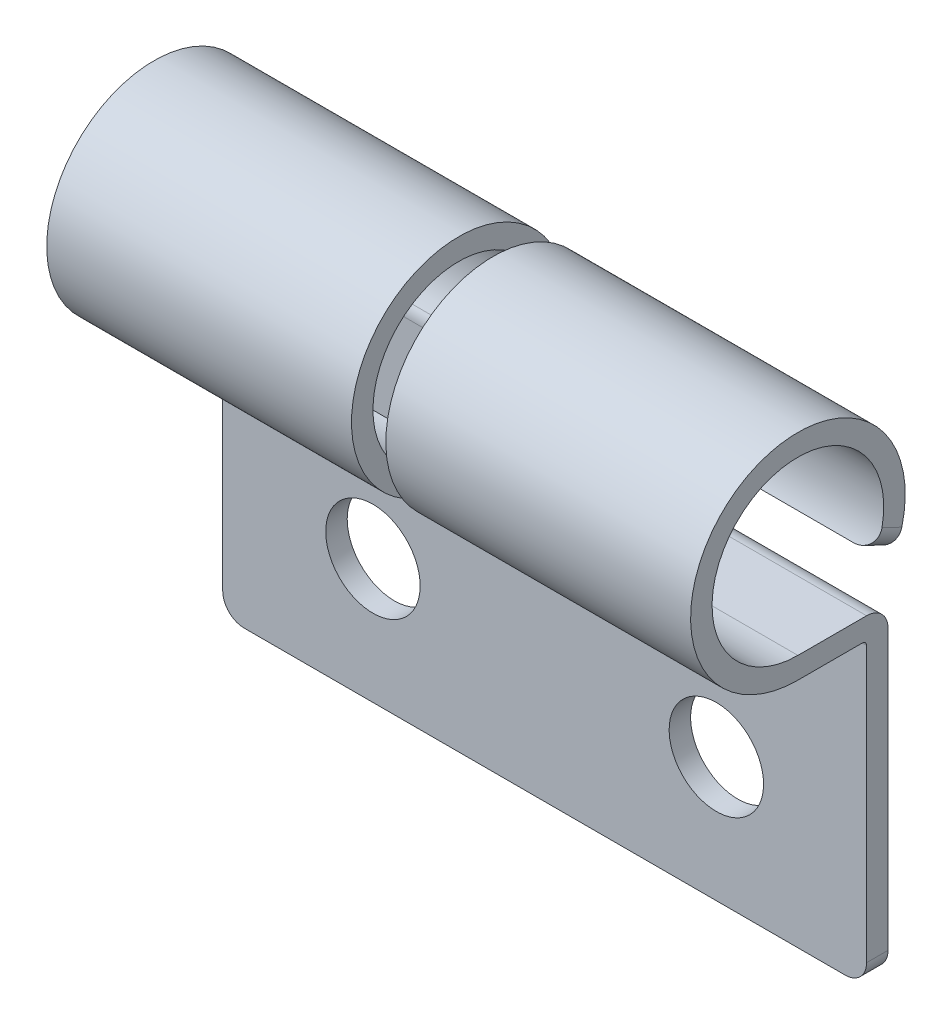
ISO-10303-21;
HEADER;
FILE_DESCRIPTION(('STEP AP214'),'2;1');
FILE_NAME('part.step','',(''),(''),'','','');
FILE_SCHEMA(('AUTOMOTIVE_DESIGN { 1 0 10303 214 1 1 1 1 }'));
ENDSEC;
DATA;
#1=APPLICATION_CONTEXT('core data for automotive mechanical design processes');
#2=APPLICATION_PROTOCOL_DEFINITION('international standard','automotive_design',2000,#1);
#3=PRODUCT_CONTEXT('',#1,'mechanical');
#4=PRODUCT('Part','Part','',(#3));
#5=PRODUCT_RELATED_PRODUCT_CATEGORY('part','',(#4));
#6=PRODUCT_DEFINITION_FORMATION('','',#4);
#7=PRODUCT_DEFINITION_CONTEXT('part definition',#1,'design');
#8=PRODUCT_DEFINITION('design','',#6,#7);
#9=PRODUCT_DEFINITION_SHAPE('','',#8);
#10=(LENGTH_UNIT() NAMED_UNIT(*) SI_UNIT(.MILLI.,.METRE.));
#11=(NAMED_UNIT(*) PLANE_ANGLE_UNIT() SI_UNIT($,.RADIAN.));
#12=(NAMED_UNIT(*) SI_UNIT($,.STERADIAN.) SOLID_ANGLE_UNIT());
#13=UNCERTAINTY_MEASURE_WITH_UNIT(LENGTH_MEASURE(1.E-05),#10,'distance_accuracy_value','');
#14=(GEOMETRIC_REPRESENTATION_CONTEXT(3) GLOBAL_UNCERTAINTY_ASSIGNED_CONTEXT((#13)) GLOBAL_UNIT_ASSIGNED_CONTEXT((#10,
#11,#12)) REPRESENTATION_CONTEXT('',''));
#15=CARTESIAN_POINT('',(0.,0.,0.));
#16=DIRECTION('',(0.,0.,1.));
#17=DIRECTION('',(1.,0.,0.));
#18=AXIS2_PLACEMENT_3D('',#15,#16,#17);
#19=CARTESIAN_POINT('',(7.5,0.,0.));
#20=DIRECTION('',(-1.,0.,0.));
#21=DIRECTION('',(0.,0.,1.));
#22=AXIS2_PLACEMENT_3D('',#19,#20,#21);
#23=CYLINDRICAL_SURFACE('',#22,2.);
#24=CARTESIAN_POINT('',(0.4,0.,0.));
#25=DIRECTION('',(1.,0.,0.));
#26=DIRECTION('',(0.,1.,0.));
#27=AXIS2_PLACEMENT_3D('',#24,#25,#26);
#28=CIRCLE('',#27,2.);
#29=CARTESIAN_POINT('',(0.4,-0.399438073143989,-1.95970641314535));
#30=VERTEX_POINT('',#29);
#31=CARTESIAN_POINT('',(0.4,-2.,0.));
#32=VERTEX_POINT('',#31);
#33=EDGE_CURVE('E229',#30,#32,#28,.T.);
#34=ORIENTED_EDGE('',*,*,#33,.F.);
#35=CARTESIAN_POINT('',(0.4,-0.399438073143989,-1.95970641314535));
#36=CARTESIAN_POINT('',(0.399971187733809,-0.426918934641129,-1.95412802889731));
#37=CARTESIAN_POINT('',(0.402209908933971,-0.45428363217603,-1.94792633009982));
#38=CARTESIAN_POINT('',(0.411174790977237,-0.508024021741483,-1.93459398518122));
#39=CARTESIAN_POINT('',(0.417899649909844,-0.534399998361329,-1.92746360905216));
#40=CARTESIAN_POINT('',(0.435802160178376,-0.585459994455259,-1.91257722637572));
#41=CARTESIAN_POINT('',(0.446986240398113,-0.610141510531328,-1.90482032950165));
#42=CARTESIAN_POINT('',(0.473532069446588,-0.657070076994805,-1.88914524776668));
#43=CARTESIAN_POINT('',(0.488891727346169,-0.679318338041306,-1.88122714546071));
#44=CARTESIAN_POINT('',(0.523093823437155,-0.720479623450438,-1.86584714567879));
#45=CARTESIAN_POINT('',(0.541876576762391,-0.739440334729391,-1.85837997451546));
#46=CARTESIAN_POINT('',(0.582565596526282,-0.77402535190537,-1.84424363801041));
#47=CARTESIAN_POINT('',(0.604472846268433,-0.789648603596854,-1.83757472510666));
#48=CARTESIAN_POINT('',(0.650946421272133,-0.817316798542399,-1.8254379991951));
#49=CARTESIAN_POINT('',(0.675529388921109,-0.829337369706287,-1.81997842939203));
#50=CARTESIAN_POINT('',(0.72654351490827,-0.849424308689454,-1.81069082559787));
#51=CARTESIAN_POINT('',(0.752973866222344,-0.857492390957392,-1.80686208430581));
#52=CARTESIAN_POINT('',(0.799578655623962,-0.867891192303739,-1.80188484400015));
#53=CARTESIAN_POINT('',(0.819497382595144,-0.871185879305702,-1.80029044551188));
#54=CARTESIAN_POINT('',(0.859608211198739,-0.875580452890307,-1.79815468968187));
#55=CARTESIAN_POINT('',(0.879799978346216,-0.87668281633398,-1.79761214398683));
#56=CARTESIAN_POINT('',(0.9,-0.8766808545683,-1.79761805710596));
#57=B_SPLINE_CURVE_WITH_KNOTS('',3,(#35,#36,#37,#38,#39,#40,#41,#42,#43,#44,#45,#46,#47,#48,#49,
#50,#51,#52,#53,#54,#55,#56),.UNSPECIFIED.,.F.,.F.,(4,2,2,2,2,2,2,2,2,2,4),(0.,
0.0840428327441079,0.168061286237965,0.252201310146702,0.33629927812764,0.419051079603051,
0.501828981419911,0.585154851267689,0.668444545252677,0.729060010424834,0.789606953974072),.UNSPECIFIED.);
#58=CARTESIAN_POINT('',(0.9,-0.8766808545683,-1.79761805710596));
#59=VERTEX_POINT('',#58);
#60=EDGE_CURVE('E312',#30,#59,#57,.T.);
#61=ORIENTED_EDGE('',*,*,#60,.T.);
#62=DIRECTION('',(-1.,0.,0.));
#63=VECTOR('',#62,1.);
#64=CARTESIAN_POINT('',(7.5,-0.8766808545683,-1.79761805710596));
#65=LINE('',#64,#63);
#66=CARTESIAN_POINT('',(7.,-0.8766808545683,-1.79761805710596));
#67=VERTEX_POINT('',#66);
#68=EDGE_CURVE('E290',#67,#59,#65,.T.);
#69=ORIENTED_EDGE('',*,*,#68,.F.);
#70=CARTESIAN_POINT('',(7.,-0.8766808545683,-1.79761805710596));
#71=CARTESIAN_POINT('',(7.02811167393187,-0.876694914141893,-1.7975924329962));
#72=CARTESIAN_POINT('',(7.05621639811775,-0.874551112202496,-1.7986563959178));
#73=CARTESIAN_POINT('',(7.11161328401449,-0.866050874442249,-1.80277452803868));
#74=CARTESIAN_POINT('',(7.13890598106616,-0.859697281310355,-1.80582735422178));
#75=CARTESIAN_POINT('',(7.19193382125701,-0.842875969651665,-1.81373675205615));
#76=CARTESIAN_POINT('',(7.21766815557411,-0.832406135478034,-1.81859425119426));
#77=CARTESIAN_POINT('',(7.26682744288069,-0.80755984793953,-1.82976313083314));
#78=CARTESIAN_POINT('',(7.29025278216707,-0.793184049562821,-1.83607426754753));
#79=CARTESIAN_POINT('',(7.33406712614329,-0.760864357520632,-1.84970021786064));
#80=CARTESIAN_POINT('',(7.35446390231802,-0.742929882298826,-1.85701236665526));
#81=CARTESIAN_POINT('',(7.39170634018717,-0.703877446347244,-1.87216295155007));
#82=CARTESIAN_POINT('',(7.40855222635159,-0.682759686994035,-1.88000135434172));
#83=CARTESIAN_POINT('',(7.43806150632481,-0.638114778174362,-1.89561657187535));
#84=CARTESIAN_POINT('',(7.45076759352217,-0.614615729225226,-1.90339315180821));
#85=CARTESIAN_POINT('',(7.47192694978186,-0.565644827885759,-1.91851540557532));
#86=CARTESIAN_POINT('',(7.48038090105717,-0.54017329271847,-1.92586114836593));
#87=CARTESIAN_POINT('',(7.49110536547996,-0.495424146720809,-1.9377636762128));
#88=CARTESIAN_POINT('',(7.49445113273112,-0.476448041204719,-1.94251901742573));
#89=CARTESIAN_POINT('',(7.49889883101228,-0.438148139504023,-1.95151665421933));
#90=CARTESIAN_POINT('',(7.50000448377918,-0.418824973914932,-1.95575978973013));
#91=CARTESIAN_POINT('',(7.5,-0.399438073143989,-1.95970641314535));
#92=B_SPLINE_CURVE_WITH_KNOTS('',3,(#70,#71,#72,#73,#74,#75,#76,#77,#78,#79,#80,#81,#82,#83,#84,
#85,#86,#87,#88,#89,#90,#91),.UNSPECIFIED.,.F.,.F.,(4,2,2,2,2,2,2,2,2,2,4),(0.,
0.0842234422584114,0.16839006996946,0.252600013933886,0.336795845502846,0.420771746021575,
0.504742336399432,0.5878173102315,0.670878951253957,0.730289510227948,0.78960128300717),.UNSPECIFIED.);
#93=CARTESIAN_POINT('',(7.5,-0.399438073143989,-1.95970641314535));
#94=VERTEX_POINT('',#93);
#95=EDGE_CURVE('E403',#67,#94,#92,.T.);
#96=ORIENTED_EDGE('',*,*,#95,.T.);
#97=CARTESIAN_POINT('',(7.5,0.,0.));
#98=DIRECTION('',(1.,0.,0.));
#99=DIRECTION('',(0.,0.,-1.));
#100=AXIS2_PLACEMENT_3D('',#97,#98,#99);
#101=CIRCLE('',#100,2.);
#102=CARTESIAN_POINT('',(7.5,-2.,0.));
#103=VERTEX_POINT('',#102);
#104=EDGE_CURVE('E275',#94,#103,#101,.T.);
#105=ORIENTED_EDGE('',*,*,#104,.T.);
#106=DIRECTION('',(-1.,0.,0.));
#107=VECTOR('',#106,1.);
#108=CARTESIAN_POINT('',(7.5,-2.,0.));
#109=LINE('',#108,#107);
#110=EDGE_CURVE('E286',#103,#32,#109,.T.);
#111=ORIENTED_EDGE('',*,*,#110,.T.);
#112=EDGE_LOOP('',(#34,#61,#69,#96,#105,#111));
#113=FACE_BOUND('',#112,.T.);
#114=ADVANCED_FACE('F34',(#113),#23,.F.);
#115=CARTESIAN_POINT('',(7.5,0.,0.));
#116=DIRECTION('',(-1.,0.,0.));
#117=DIRECTION('',(0.,0.,1.));
#118=AXIS2_PLACEMENT_3D('',#115,#116,#117);
#119=CYLINDRICAL_SURFACE('',#118,2.5);
#120=CARTESIAN_POINT('',(-0.399999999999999,0.,0.));
#121=DIRECTION('',(-1.,0.,0.));
#122=DIRECTION('',(0.,0.,1.));
#123=AXIS2_PLACEMENT_3D('',#120,#121,#122);
#124=CIRCLE('',#123,2.5);
#125=CARTESIAN_POINT('',(-0.399999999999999,-2.44948974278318,0.5));
#126=VERTEX_POINT('',#125);
#127=CARTESIAN_POINT('',(-0.399999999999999,-1.33234677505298,-2.11538461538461));
#128=VERTEX_POINT('',#127);
#129=EDGE_CURVE('E487',#126,#128,#124,.T.);
#130=ORIENTED_EDGE('',*,*,#129,.T.);
#131=DIRECTION('',(-1.,0.,0.));
#132=VECTOR('',#131,1.);
#133=CARTESIAN_POINT('',(7.5,-1.33234677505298,-2.11538461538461));
#134=LINE('',#133,#132);
#135=CARTESIAN_POINT('',(-7.5,-1.33234677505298,-2.11538461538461));
#136=VERTEX_POINT('',#135);
#137=EDGE_CURVE('E49',#128,#136,#134,.T.);
#138=ORIENTED_EDGE('',*,*,#137,.T.);
#139=CARTESIAN_POINT('',(-7.5,0.,0.));
#140=DIRECTION('',(-1.,0.,0.));
#141=DIRECTION('',(0.,0.,1.));
#142=AXIS2_PLACEMENT_3D('',#139,#140,#141);
#143=CIRCLE('',#142,2.5);
#144=CARTESIAN_POINT('',(-7.5,-2.44948974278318,0.5));
#145=VERTEX_POINT('',#144);
#146=EDGE_CURVE('E250',#145,#136,#143,.T.);
#147=ORIENTED_EDGE('',*,*,#146,.F.);
#148=CARTESIAN_POINT('',(-7.5,-2.44948974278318,0.5));
#149=CARTESIAN_POINT('',(-7.50002723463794,-2.45512197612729,0.47249827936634));
#150=CARTESIAN_POINT('',(-7.49773190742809,-2.46025688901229,0.444890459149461));
#151=CARTESIAN_POINT('',(-7.48858967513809,-2.46949921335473,0.39027706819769));
#152=CARTESIAN_POINT('',(-7.48174492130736,-2.47360710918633,0.363271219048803));
#153=CARTESIAN_POINT('',(-7.46358720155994,-2.4807718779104,0.310619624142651));
#154=CARTESIAN_POINT('',(-7.45226930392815,-2.48382758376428,0.284975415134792));
#155=CARTESIAN_POINT('',(-7.4254638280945,-2.48896992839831,0.235874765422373));
#156=CARTESIAN_POINT('',(-7.40997784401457,-2.49105693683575,0.21241749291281));
#157=CARTESIAN_POINT('',(-7.37544375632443,-2.49440286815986,0.168621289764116));
#158=CARTESIAN_POINT('',(-7.35643413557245,-2.49567012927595,0.148252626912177));
#159=CARTESIAN_POINT('',(-7.31527711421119,-2.49760756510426,0.110934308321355));
#160=CARTESIAN_POINT('',(-7.29312885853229,-2.49827757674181,0.093985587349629));
#161=CARTESIAN_POINT('',(-7.24621783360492,-2.49922805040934,0.0639305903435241));
#162=CARTESIAN_POINT('',(-7.2214438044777,-2.49950675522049,0.0508418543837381));
#163=CARTESIAN_POINT('',(-7.17006335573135,-2.49985600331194,0.0289830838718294));
#164=CARTESIAN_POINT('',(-7.14345783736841,-2.49992664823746,0.0202109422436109));
#165=CARTESIAN_POINT('',(-7.09727684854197,-2.49998741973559,0.00916269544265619));
#166=CARTESIAN_POINT('',(-7.07796984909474,-2.49999527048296,0.00572966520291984));
#167=CARTESIAN_POINT('',(-7.03911111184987,-2.50000000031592,0.00114796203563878));
#168=CARTESIAN_POINT('',(-7.01955970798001,-2.49999689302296,-3.54417115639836E-06));
#169=CARTESIAN_POINT('',(-7.,-2.5,0.));
#170=B_SPLINE_CURVE_WITH_KNOTS('',3,(#148,#149,#150,#151,#152,#153,#154,#155,#156,#157,#158,
#159,#160,#161,#162,#163,#164,#165,#166,#167,#168,#169),.UNSPECIFIED.,.F.,.F.,(4,2,2,2,2,2,2,2,
2,2,4),(0.,0.0841256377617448,0.168211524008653,0.25239037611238,0.33653707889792,
0.419813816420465,0.503113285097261,0.586785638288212,0.670417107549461,0.729119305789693,
0.787748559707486),.UNSPECIFIED.);
#171=CARTESIAN_POINT('',(-7.,-2.5,0.));
#172=VERTEX_POINT('',#171);
#173=EDGE_CURVE('E353',#145,#172,#170,.T.);
#174=ORIENTED_EDGE('',*,*,#173,.T.);
#175=DIRECTION('',(1.,0.,0.));
#176=VECTOR('',#175,1.);
#177=CARTESIAN_POINT('',(-7.5,-2.5,0.));
#178=LINE('',#177,#176);
#179=CARTESIAN_POINT('',(-0.9,-2.5,0.));
#180=VERTEX_POINT('',#179);
#181=EDGE_CURVE('E252',#172,#180,#178,.T.);
#182=ORIENTED_EDGE('',*,*,#181,.T.);
#183=CARTESIAN_POINT('',(-0.9,-2.5,0.));
#184=CARTESIAN_POINT('',(-0.871882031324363,-2.49998649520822,-2.38767705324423E-05));
#185=CARTESIAN_POINT('',(-0.843771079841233,-2.49999977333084,0.00237043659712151));
#186=CARTESIAN_POINT('',(-0.7883633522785,-2.49998008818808,0.0118196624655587));
#187=CARTESIAN_POINT('',(-0.761066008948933,-2.49994715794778,0.0188712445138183));
#188=CARTESIAN_POINT('',(-0.708029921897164,-2.49973546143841,0.0374643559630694));
#189=CARTESIAN_POINT('',(-0.682291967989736,-2.49955662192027,0.0490081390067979));
#190=CARTESIAN_POINT('',(-0.633125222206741,-2.4988742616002,0.0762464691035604));
#191=CARTESIAN_POINT('',(-0.609696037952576,-2.498370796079,0.0919403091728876));
#192=CARTESIAN_POINT('',(-0.565849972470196,-2.4968335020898,0.126998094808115));
#193=CARTESIAN_POINT('',(-0.54542810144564,-2.49580056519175,0.14635583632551));
#194=CARTESIAN_POINT('',(-0.508133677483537,-2.49299482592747,0.188189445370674));
#195=CARTESIAN_POINT('',(-0.491261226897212,-2.49122200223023,0.210665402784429));
#196=CARTESIAN_POINT('',(-0.461644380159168,-2.48677497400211,0.257892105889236));
#197=CARTESIAN_POINT('',(-0.448872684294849,-2.48410698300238,0.282626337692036));
#198=CARTESIAN_POINT('',(-0.427635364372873,-2.47775486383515,0.333755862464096));
#199=CARTESIAN_POINT('',(-0.419168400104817,-2.47407105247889,0.360150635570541));
#200=CARTESIAN_POINT('',(-0.408624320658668,-2.46695406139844,0.405577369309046));
#201=CARTESIAN_POINT('',(-0.405384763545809,-2.46378906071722,0.424391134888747));
#202=CARTESIAN_POINT('',(-0.40107249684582,-2.45698771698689,0.462150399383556));
#203=CARTESIAN_POINT('',(-0.399996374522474,-2.45335212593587,0.481095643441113));
#204=CARTESIAN_POINT('',(-0.4,-2.44948974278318,0.5));
#205=B_SPLINE_CURVE_WITH_KNOTS('',3,(#183,#184,#185,#186,#187,#188,#189,#190,#191,#192,#193,
#194,#195,#196,#197,#198,#199,#200,#201,#202,#203,#204),.UNSPECIFIED.,.F.,.F.,(4,2,2,2,2,2,2,2,
2,2,4),(0.,0.0842421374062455,0.168424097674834,0.252648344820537,0.336858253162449,
0.420926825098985,0.504997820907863,0.588496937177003,0.671970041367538,0.729903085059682,
0.787744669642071),.UNSPECIFIED.);
#206=EDGE_CURVE('E361',#180,#126,#205,.T.);
#207=ORIENTED_EDGE('',*,*,#206,.T.);
#208=EDGE_LOOP('',(#130,#138,#147,#174,#182,#207));
#209=FACE_BOUND('',#208,.T.);
#210=ADVANCED_FACE('F348',(#209),#119,.T.);
#211=CARTESIAN_POINT('',(7.5,-2.5,-1.6));
#212=DIRECTION('',(0.,0.,-1.));
#213=DIRECTION('',(0.,1.,0.));
#214=AXIS2_PLACEMENT_3D('',#211,#212,#213);
#215=PLANE('',#214);
#216=CARTESIAN_POINT('',(4.,-6.6,-1.6));
#217=DIRECTION('',(0.,0.,-1.));
#218=DIRECTION('',(0.,1.,0.));
#219=AXIS2_PLACEMENT_3D('',#216,#217,#218);
#220=CIRCLE('',#219,1.1);
#221=CARTESIAN_POINT('',(4.,-5.5,-1.6));
#222=VERTEX_POINT('',#221);
#223=EDGE_CURVE('E497',#222,#222,#220,.T.);
#224=ORIENTED_EDGE('',*,*,#223,.T.);
#225=EDGE_LOOP('',(#224));
#226=FACE_BOUND('',#225,.T.);
#227=CARTESIAN_POINT('',(-4.,-6.6,-1.6));
#228=DIRECTION('',(0.,0.,-1.));
#229=DIRECTION('',(0.,1.,0.));
#230=AXIS2_PLACEMENT_3D('',#227,#228,#229);
#231=CIRCLE('',#230,1.1);
#232=CARTESIAN_POINT('',(-4.,-5.5,-1.6));
#233=VERTEX_POINT('',#232);
#234=EDGE_CURVE('E214',#233,#233,#231,.T.);
#235=ORIENTED_EDGE('',*,*,#234,.T.);
#236=EDGE_LOOP('',(#235));
#237=FACE_BOUND('',#236,.T.);
#238=DIRECTION('',(0.,-1.,0.));
#239=VECTOR('',#238,1.);
#240=CARTESIAN_POINT('',(7.5,-2.5,-1.6));
#241=LINE('',#240,#239);
#242=CARTESIAN_POINT('',(7.5,-2.6,-1.6));
#243=VERTEX_POINT('',#242);
#244=CARTESIAN_POINT('',(7.5,-9.,-1.6));
#245=VERTEX_POINT('',#244);
#246=EDGE_CURVE('E264',#243,#245,#241,.T.);
#247=ORIENTED_EDGE('',*,*,#246,.F.);
#248=DIRECTION('',(-1.,0.,0.));
#249=VECTOR('',#248,1.);
#250=CARTESIAN_POINT('',(0.4,-2.6,-1.6));
#251=LINE('',#250,#249);
#252=CARTESIAN_POINT('',(0.4,-2.6,-1.6));
#253=VERTEX_POINT('',#252);
#254=EDGE_CURVE('E442',#243,#253,#251,.T.);
#255=ORIENTED_EDGE('',*,*,#254,.T.);
#256=DIRECTION('',(0.,-1.,0.));
#257=VECTOR('',#256,1.);
#258=CARTESIAN_POINT('',(0.4,-2.5,-1.6));
#259=LINE('',#258,#257);
#260=CARTESIAN_POINT('',(0.4,-3.1,-1.6));
#261=VERTEX_POINT('',#260);
#262=EDGE_CURVE('E221',#253,#261,#259,.T.);
#263=ORIENTED_EDGE('',*,*,#262,.T.);
#264=CARTESIAN_POINT('',(0.,-3.1,-1.6));
#265=DIRECTION('',(0.,0.,-1.));
#266=DIRECTION('',(0.,1.,0.));
#267=AXIS2_PLACEMENT_3D('',#264,#265,#266);
#268=CIRCLE('',#267,0.4);
#269=CARTESIAN_POINT('',(-0.4,-3.1,-1.6));
#270=VERTEX_POINT('',#269);
#271=EDGE_CURVE('E238',#261,#270,#268,.T.);
#272=ORIENTED_EDGE('',*,*,#271,.T.);
#273=DIRECTION('',(0.,1.,0.));
#274=VECTOR('',#273,1.);
#275=CARTESIAN_POINT('',(-0.399999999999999,-2.5,-1.6));
#276=LINE('',#275,#274);
#277=CARTESIAN_POINT('',(-0.4,-1.35646599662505,-1.6));
#278=VERTEX_POINT('',#277);
#279=EDGE_CURVE('E213',#270,#278,#276,.T.);
#280=ORIENTED_EDGE('',*,*,#279,.T.);
#281=DIRECTION('',(1.,0.,0.));
#282=VECTOR('',#281,1.);
#283=CARTESIAN_POINT('',(-7.5,-1.35646599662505,-1.6));
#284=LINE('',#283,#282);
#285=CARTESIAN_POINT('',(-7.5,-1.35646599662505,-1.6));
#286=VERTEX_POINT('',#285);
#287=EDGE_CURVE('E261',#286,#278,#284,.T.);
#288=ORIENTED_EDGE('',*,*,#287,.F.);
#289=DIRECTION('',(0.,-1.,0.));
#290=VECTOR('',#289,1.);
#291=CARTESIAN_POINT('',(-7.5,-9.5,-1.6));
#292=LINE('',#291,#290);
#293=CARTESIAN_POINT('',(-7.5,-9.,-1.6));
#294=VERTEX_POINT('',#293);
#295=EDGE_CURVE('E242',#286,#294,#292,.T.);
#296=ORIENTED_EDGE('',*,*,#295,.T.);
#297=CARTESIAN_POINT('',(-7.,-9.,-1.6));
#298=DIRECTION('',(0.,0.,-1.));
#299=DIRECTION('',(0.,1.,0.));
#300=AXIS2_PLACEMENT_3D('',#297,#298,#299);
#301=CIRCLE('',#300,0.5);
#302=CARTESIAN_POINT('',(-7.,-9.5,-1.6));
#303=VERTEX_POINT('',#302);
#304=EDGE_CURVE('E426',#294,#303,#301,.F.);
#305=ORIENTED_EDGE('',*,*,#304,.T.);
#306=DIRECTION('',(-1.,0.,0.));
#307=VECTOR('',#306,1.);
#308=CARTESIAN_POINT('',(7.5,-9.5,-1.6));
#309=LINE('',#308,#307);
#310=CARTESIAN_POINT('',(7.,-9.5,-1.6));
#311=VERTEX_POINT('',#310);
#312=EDGE_CURVE('E297',#311,#303,#309,.T.);
#313=ORIENTED_EDGE('',*,*,#312,.F.);
#314=CARTESIAN_POINT('',(7.,-9.,-1.6));
#315=DIRECTION('',(0.,0.,-1.));
#316=DIRECTION('',(0.,1.,0.));
#317=AXIS2_PLACEMENT_3D('',#314,#315,#316);
#318=CIRCLE('',#317,0.5);
#319=EDGE_CURVE('E432',#311,#245,#318,.F.);
#320=ORIENTED_EDGE('',*,*,#319,.T.);
#321=EDGE_LOOP('',(#247,#255,#263,#272,#280,#288,#296,#305,#313,#320));
#322=FACE_BOUND('',#321,.T.);
#323=ADVANCED_FACE('F376',(#226,#237,#322),#215,.F.);
#324=CARTESIAN_POINT('',(7.5,-9.5,-2.1));
#325=DIRECTION('',(0.,-1.,0.));
#326=DIRECTION('',(0.,0.,-1.));
#327=AXIS2_PLACEMENT_3D('',#324,#325,#326);
#328=PLANE('',#327);
#329=ORIENTED_EDGE('',*,*,#312,.T.);
#330=DIRECTION('',(0.,0.,-1.));
#331=VECTOR('',#330,1.);
#332=CARTESIAN_POINT('',(-7.,-9.5,-2.1));
#333=LINE('',#332,#331);
#334=CARTESIAN_POINT('',(-7.,-9.5,-2.1));
#335=VERTEX_POINT('',#334);
#336=EDGE_CURVE('E430',#303,#335,#333,.T.);
#337=ORIENTED_EDGE('',*,*,#336,.T.);
#338=DIRECTION('',(-1.,0.,0.));
#339=VECTOR('',#338,1.);
#340=CARTESIAN_POINT('',(7.5,-9.5,-2.1));
#341=LINE('',#340,#339);
#342=CARTESIAN_POINT('',(7.,-9.5,-2.1));
#343=VERTEX_POINT('',#342);
#344=EDGE_CURVE('E294',#343,#335,#341,.T.);
#345=ORIENTED_EDGE('',*,*,#344,.F.);
#346=DIRECTION('',(0.,0.,1.));
#347=VECTOR('',#346,1.);
#348=CARTESIAN_POINT('',(7.,-9.5,-1.6));
#349=LINE('',#348,#347);
#350=EDGE_CURVE('E548',#343,#311,#349,.T.);
#351=ORIENTED_EDGE('',*,*,#350,.T.);
#352=EDGE_LOOP('',(#329,#337,#345,#351));
#353=FACE_BOUND('',#352,.T.);
#354=ADVANCED_FACE('F509',(#353),#328,.T.);
#355=CARTESIAN_POINT('',(7.5,-2.5,-2.1));
#356=DIRECTION('',(0.,0.,-1.));
#357=DIRECTION('',(0.,1.,0.));
#358=AXIS2_PLACEMENT_3D('',#355,#356,#357);
#359=PLANE('',#358);
#360=CARTESIAN_POINT('',(4.,-6.6,-2.1));
#361=DIRECTION('',(0.,0.,-1.));
#362=DIRECTION('',(0.,1.,0.));
#363=AXIS2_PLACEMENT_3D('',#360,#361,#362);
#364=CIRCLE('',#363,1.1);
#365=CARTESIAN_POINT('',(4.,-5.5,-2.1));
#366=VERTEX_POINT('',#365);
#367=EDGE_CURVE('E500',#366,#366,#364,.T.);
#368=ORIENTED_EDGE('',*,*,#367,.F.);
#369=EDGE_LOOP('',(#368));
#370=FACE_BOUND('',#369,.T.);
#371=CARTESIAN_POINT('',(-4.,-6.6,-2.1));
#372=DIRECTION('',(0.,0.,-1.));
#373=DIRECTION('',(0.,-1.,0.));
#374=AXIS2_PLACEMENT_3D('',#371,#372,#373);
#375=CIRCLE('',#374,1.1);
#376=CARTESIAN_POINT('',(-4.,-7.7,-2.1));
#377=VERTEX_POINT('',#376);
#378=EDGE_CURVE('E494',#377,#377,#375,.T.);
#379=ORIENTED_EDGE('',*,*,#378,.F.);
#380=EDGE_LOOP('',(#379));
#381=FACE_BOUND('',#380,.T.);
#382=DIRECTION('',(0.,-1.,0.));
#383=VECTOR('',#382,1.);
#384=CARTESIAN_POINT('',(-7.5,-9.5,-2.1));
#385=LINE('',#384,#383);
#386=CARTESIAN_POINT('',(-7.5,-1.3856406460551,-2.1));
#387=VERTEX_POINT('',#386);
#388=CARTESIAN_POINT('',(-7.5,-9.,-2.1));
#389=VERTEX_POINT('',#388);
#390=EDGE_CURVE('E240',#387,#389,#385,.T.);
#391=ORIENTED_EDGE('',*,*,#390,.F.);
#392=DIRECTION('',(-1.,0.,0.));
#393=VECTOR('',#392,1.);
#394=CARTESIAN_POINT('',(7.5,-1.3856406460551,-2.1));
#395=LINE('',#394,#393);
#396=CARTESIAN_POINT('',(-0.399999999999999,-1.3856406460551,-2.1));
#397=VERTEX_POINT('',#396);
#398=EDGE_CURVE('E220',#387,#397,#395,.F.);
#399=ORIENTED_EDGE('',*,*,#398,.T.);
#400=DIRECTION('',(0.,1.,0.));
#401=VECTOR('',#400,1.);
#402=CARTESIAN_POINT('',(-0.399999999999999,-2.5,-2.1));
#403=LINE('',#402,#401);
#404=CARTESIAN_POINT('',(-0.4,-3.1,-2.1));
#405=VERTEX_POINT('',#404);
#406=EDGE_CURVE('E211',#405,#397,#403,.T.);
#407=ORIENTED_EDGE('',*,*,#406,.F.);
#408=CARTESIAN_POINT('',(0.,-3.1,-2.1));
#409=DIRECTION('',(0.,0.,-1.));
#410=DIRECTION('',(0.,1.,0.));
#411=AXIS2_PLACEMENT_3D('',#408,#409,#410);
#412=CIRCLE('',#411,0.4);
#413=CARTESIAN_POINT('',(0.4,-3.1,-2.1));
#414=VERTEX_POINT('',#413);
#415=EDGE_CURVE('E196',#414,#405,#412,.T.);
#416=ORIENTED_EDGE('',*,*,#415,.F.);
#417=DIRECTION('',(0.,-1.,0.));
#418=VECTOR('',#417,1.);
#419=CARTESIAN_POINT('',(0.4,-2.5,-2.1));
#420=LINE('',#419,#418);
#421=CARTESIAN_POINT('',(0.4,-2.5,-2.1));
#422=VERTEX_POINT('',#421);
#423=EDGE_CURVE('E236',#422,#414,#420,.T.);
#424=ORIENTED_EDGE('',*,*,#423,.F.);
#425=DIRECTION('',(-1.,0.,0.));
#426=VECTOR('',#425,1.);
#427=CARTESIAN_POINT('',(7.5,-2.5,-2.1));
#428=LINE('',#427,#426);
#429=CARTESIAN_POINT('',(7.5,-2.5,-2.1));
#430=VERTEX_POINT('',#429);
#431=EDGE_CURVE('E293',#430,#422,#428,.T.);
#432=ORIENTED_EDGE('',*,*,#431,.F.);
#433=DIRECTION('',(0.,-1.,0.));
#434=VECTOR('',#433,1.);
#435=CARTESIAN_POINT('',(7.5,-2.5,-2.1));
#436=LINE('',#435,#434);
#437=CARTESIAN_POINT('',(7.5,-9.,-2.1));
#438=VERTEX_POINT('',#437);
#439=EDGE_CURVE('E266',#430,#438,#436,.T.);
#440=ORIENTED_EDGE('',*,*,#439,.T.);
#441=CARTESIAN_POINT('',(7.,-9.,-2.1));
#442=DIRECTION('',(0.,0.,-1.));
#443=DIRECTION('',(0.,1.,0.));
#444=AXIS2_PLACEMENT_3D('',#441,#442,#443);
#445=CIRCLE('',#444,0.5);
#446=EDGE_CURVE('E542',#438,#343,#445,.T.);
#447=ORIENTED_EDGE('',*,*,#446,.T.);
#448=ORIENTED_EDGE('',*,*,#344,.T.);
#449=CARTESIAN_POINT('',(-7.,-9.,-2.1));
#450=DIRECTION('',(0.,0.,-1.));
#451=DIRECTION('',(0.,1.,0.));
#452=AXIS2_PLACEMENT_3D('',#449,#450,#451);
#453=CIRCLE('',#452,0.5);
#454=EDGE_CURVE('E437',#335,#389,#453,.T.);
#455=ORIENTED_EDGE('',*,*,#454,.T.);
#456=EDGE_LOOP('',(#391,#399,#407,#416,#424,#432,#440,#447,#448,#455));
#457=FACE_BOUND('',#456,.T.);
#458=ADVANCED_FACE('F218',(#370,#381,#457),#359,.T.);
#459=CARTESIAN_POINT('',(7.5,-2.5,-1.6));
#460=DIRECTION('',(-1.,0.,0.));
#461=DIRECTION('',(0.,0.,1.));
#462=AXIS2_PLACEMENT_3D('',#459,#460,#461);
#463=CYLINDRICAL_SURFACE('',#462,0.5);
#464=CARTESIAN_POINT('',(0.4,-2.5,-1.6));
#465=DIRECTION('',(1.,0.,0.));
#466=DIRECTION('',(0.,1.,0.));
#467=AXIS2_PLACEMENT_3D('',#464,#465,#466);
#468=CIRCLE('',#467,0.5);
#469=CARTESIAN_POINT('',(0.4,-2.,-1.6));
#470=VERTEX_POINT('',#469);
#471=EDGE_CURVE('E234',#470,#422,#468,.F.);
#472=ORIENTED_EDGE('',*,*,#471,.F.);
#473=DIRECTION('',(-1.,0.,0.));
#474=VECTOR('',#473,1.);
#475=CARTESIAN_POINT('',(7.5,-2.,-1.6));
#476=LINE('',#475,#474);
#477=CARTESIAN_POINT('',(7.5,-2.,-1.6));
#478=VERTEX_POINT('',#477);
#479=EDGE_CURVE('E289',#478,#470,#476,.T.);
#480=ORIENTED_EDGE('',*,*,#479,.F.);
#481=CARTESIAN_POINT('',(7.5,-2.5,-1.6));
#482=DIRECTION('',(-1.,0.,0.));
#483=DIRECTION('',(0.,0.,1.));
#484=AXIS2_PLACEMENT_3D('',#481,#482,#483);
#485=CIRCLE('',#484,0.5);
#486=EDGE_CURVE('E269',#478,#430,#485,.T.);
#487=ORIENTED_EDGE('',*,*,#486,.T.);
#488=ORIENTED_EDGE('',*,*,#431,.T.);
#489=EDGE_LOOP('',(#472,#480,#487,#488));
#490=FACE_BOUND('',#489,.T.);
#491=ADVANCED_FACE('F508',(#490),#463,.T.);
#492=CARTESIAN_POINT('',(7.5,-2.,0.));
#493=DIRECTION('',(0.,1.,0.));
#494=DIRECTION('',(0.,0.,1.));
#495=AXIS2_PLACEMENT_3D('',#492,#493,#494);
#496=PLANE('',#495);
#497=DIRECTION('',(0.,0.,-1.));
#498=VECTOR('',#497,1.);
#499=CARTESIAN_POINT('',(0.4,-2.,0.));
#500=LINE('',#499,#498);
#501=EDGE_CURVE('E232',#32,#470,#500,.T.);
#502=ORIENTED_EDGE('',*,*,#501,.F.);
#503=ORIENTED_EDGE('',*,*,#110,.F.);
#504=DIRECTION('',(0.,0.,-1.));
#505=VECTOR('',#504,1.);
#506=CARTESIAN_POINT('',(7.5,-2.,0.));
#507=LINE('',#506,#505);
#508=EDGE_CURVE('E272',#103,#478,#507,.T.);
#509=ORIENTED_EDGE('',*,*,#508,.T.);
#510=ORIENTED_EDGE('',*,*,#479,.T.);
#511=EDGE_LOOP('',(#502,#503,#509,#510));
#512=FACE_BOUND('',#511,.T.);
#513=ADVANCED_FACE('F397',(#512),#496,.T.);
#514=CARTESIAN_POINT('',(-0.399999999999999,0.,0.));
#515=DIRECTION('',(-1.,0.,0.));
#516=DIRECTION('',(0.,0.,1.));
#517=AXIS2_PLACEMENT_3D('',#514,#515,#516);
#518=CIRCLE('',#517,2.);
#519=CARTESIAN_POINT('',(-0.399999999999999,-1.93649167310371,0.5));
#520=VERTEX_POINT('',#519);
#521=CARTESIAN_POINT('',(-0.399999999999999,-1.08517279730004,-1.68));
#522=VERTEX_POINT('',#521);
#523=EDGE_CURVE('E485',#520,#522,#518,.T.);
#524=ORIENTED_EDGE('',*,*,#523,.F.);
#525=CARTESIAN_POINT('',(-0.4,-1.93649167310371,0.5));
#526=CARTESIAN_POINT('',(-0.399971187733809,-1.94352374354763,0.472854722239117));
#527=CARTESIAN_POINT('',(-0.402209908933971,-1.94994465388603,0.445540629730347));
#528=CARTESIAN_POINT('',(-0.411174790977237,-1.96151800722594,0.391394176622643));
#529=CARTESIAN_POINT('',(-0.417899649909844,-1.96667081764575,0.364561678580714));
#530=CARTESIAN_POINT('',(-0.435802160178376,-1.97567246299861,0.312143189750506));
#531=CARTESIAN_POINT('',(-0.446986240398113,-1.97951940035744,0.286559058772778));
#532=CARTESIAN_POINT('',(-0.473532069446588,-1.98600118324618,0.237508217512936));
#533=CARTESIAN_POINT('',(-0.488891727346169,-1.98863663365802,0.21404045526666));
#534=CARTESIAN_POINT('',(-0.523093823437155,-1.99285560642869,0.17030264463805));
#535=CARTESIAN_POINT('',(-0.541876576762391,-1.99445529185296,0.1499874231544));
#536=CARTESIAN_POINT('',(-0.582565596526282,-1.99690943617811,0.112705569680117));
#537=CARTESIAN_POINT('',(-0.604472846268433,-1.9977636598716,0.0957399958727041));
#538=CARTESIAN_POINT('',(-0.650946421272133,-1.99898314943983,0.0655515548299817));
#539=CARTESIAN_POINT('',(-0.675529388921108,-1.999345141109,0.0523542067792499));
#540=CARTESIAN_POINT('',(-0.72654351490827,-1.99980227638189,0.0302287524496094));
#541=CARTESIAN_POINT('',(-0.752973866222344,-1.99989753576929,0.0212987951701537));
#542=CARTESIAN_POINT('',(-0.799578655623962,-1.99998216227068,0.00977053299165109));
#543=CARTESIAN_POINT('',(-0.819497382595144,-1.99999329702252,0.00611034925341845));
#544=CARTESIAN_POINT('',(-0.859608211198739,-1.99999997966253,0.00122427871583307));
#545=CARTESIAN_POINT('',(-0.879799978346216,-1.99999554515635,-4.35521186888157E-06));
#546=CARTESIAN_POINT('',(-0.9,-2.,0.));
#547=B_SPLINE_CURVE_WITH_KNOTS('',3,(#525,#526,#527,#528,#529,#530,#531,#532,#533,#534,#535,
#536,#537,#538,#539,#540,#541,#542,#543,#544,#545,#546),.UNSPECIFIED.,.F.,.F.,(4,2,2,2,2,2,2,2,
2,2,4),(0.,0.084042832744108,0.168061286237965,0.252201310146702,0.33629927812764,
0.419051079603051,0.501828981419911,0.585154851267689,0.668444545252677,0.729060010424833,
0.789606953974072),.UNSPECIFIED.);
#548=CARTESIAN_POINT('',(-0.9,-2.,0.));
#549=VERTEX_POINT('',#548);
#550=EDGE_CURVE('E381',#520,#549,#547,.T.);
#551=ORIENTED_EDGE('',*,*,#550,.T.);
#552=DIRECTION('',(1.,0.,0.));
#553=VECTOR('',#552,1.);
#554=CARTESIAN_POINT('',(-7.5,-2.,0.));
#555=LINE('',#554,#553);
#556=CARTESIAN_POINT('',(-7.,-2.,0.));
#557=VERTEX_POINT('',#556);
#558=EDGE_CURVE('E255',#557,#549,#555,.T.);
#559=ORIENTED_EDGE('',*,*,#558,.F.);
#560=CARTESIAN_POINT('',(-7.,-2.,0.));
#561=CARTESIAN_POINT('',(-7.02811167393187,-1.9999831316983,-2.38689549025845E-05));
#562=CARTESIAN_POINT('',(-7.05621639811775,-1.99999971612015,0.00236937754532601));
#563=CARTESIAN_POINT('',(-7.11161328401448,-1.99997513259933,0.0118146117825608));
#564=CARTESIAN_POINT('',(-7.13890598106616,-1.99993400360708,0.0188634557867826));
#565=CARTESIAN_POINT('',(-7.19193382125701,-1.99966958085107,0.0374496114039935));
#566=CARTESIAN_POINT('',(-7.21766815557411,-1.99944619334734,0.04898923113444));
#567=CARTESIAN_POINT('',(-7.26682744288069,-1.99859375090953,0.0762170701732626));
#568=CARTESIAN_POINT('',(-7.29025278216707,-1.99796476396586,0.0919045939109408));
#569=CARTESIAN_POINT('',(-7.33406712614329,-1.99604486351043,0.126926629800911));
#570=CARTESIAN_POINT('',(-7.35446390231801,-1.99475568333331,0.14625150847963));
#571=CARTESIAN_POINT('',(-7.39170634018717,-1.99125490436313,0.187993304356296));
#572=CARTESIAN_POINT('',(-7.40855222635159,-1.98904336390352,0.210410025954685));
#573=CARTESIAN_POINT('',(-7.43806150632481,-1.98350879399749,0.257382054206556));
#574=CARTESIAN_POINT('',(-7.45076759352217,-1.98019787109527,0.281912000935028));
#575=CARTESIAN_POINT('',(-7.47192694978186,-1.97232396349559,0.332556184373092));
#576=CARTESIAN_POINT('',(-7.48038090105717,-1.96776117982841,0.358670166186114));
#577=CARTESIAN_POINT('',(-7.49110536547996,-1.95884391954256,0.404108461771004));
#578=CARTESIAN_POINT('',(-7.49445113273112,-1.95480006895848,0.423248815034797));
#579=CARTESIAN_POINT('',(-7.49889883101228,-1.94609883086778,0.461617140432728));
#580=CARTESIAN_POINT('',(-7.50000448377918,-1.94144247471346,0.480844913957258));
#581=CARTESIAN_POINT('',(-7.5,-1.93649167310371,0.5));
#582=B_SPLINE_CURVE_WITH_KNOTS('',3,(#560,#561,#562,#563,#564,#565,#566,#567,#568,#569,#570,
#571,#572,#573,#574,#575,#576,#577,#578,#579,#580,#581),.UNSPECIFIED.,.F.,.F.,(4,2,2,2,2,2,2,2,
2,2,4),(0.,0.0842234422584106,0.168390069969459,0.252600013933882,0.336795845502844,
0.420771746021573,0.504742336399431,0.587817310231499,0.670878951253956,0.730289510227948,
0.78960128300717),.UNSPECIFIED.);
#583=CARTESIAN_POINT('',(-7.5,-1.93649167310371,0.5));
#584=VERTEX_POINT('',#583);
#585=EDGE_CURVE('E388',#557,#584,#582,.T.);
#586=ORIENTED_EDGE('',*,*,#585,.T.);
#587=CARTESIAN_POINT('',(-7.5,0.,0.));
#588=DIRECTION('',(-1.,0.,0.));
#589=DIRECTION('',(0.,0.,1.));
#590=AXIS2_PLACEMENT_3D('',#587,#588,#589);
#591=CIRCLE('',#590,2.);
#592=CARTESIAN_POINT('',(-7.5,-1.08517279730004,-1.68));
#593=VERTEX_POINT('',#592);
#594=EDGE_CURVE('E248',#584,#593,#591,.T.);
#595=ORIENTED_EDGE('',*,*,#594,.T.);
#596=DIRECTION('',(1.,0.,0.));
#597=VECTOR('',#596,1.);
#598=CARTESIAN_POINT('',(-7.5,-1.08517279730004,-1.68));
#599=LINE('',#598,#597);
#600=EDGE_CURVE('E258',#593,#522,#599,.T.);
#601=ORIENTED_EDGE('',*,*,#600,.T.);
#602=EDGE_LOOP('',(#524,#551,#559,#586,#595,#601));
#603=FACE_BOUND('',#602,.T.);
#604=ADVANCED_FACE('F393',(#603),#23,.F.);
#605=CARTESIAN_POINT('',(7.5,-1.09585106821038,-2.24702257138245));
#606=DIRECTION('',(0.,-0.898809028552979,0.43834042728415));
#607=DIRECTION('',(0.,-0.43834042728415,-0.898809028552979));
#608=AXIS2_PLACEMENT_3D('',#605,#606,#607);
#609=PLANE('',#608);
#610=ORIENTED_EDGE('',*,*,#68,.T.);
#611=DIRECTION('',(0.,0.43834042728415,0.898809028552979));
#612=VECTOR('',#611,1.);
#613=CARTESIAN_POINT('',(0.9,-1.09585106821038,-2.24702257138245));
#614=LINE('',#613,#612);
#615=CARTESIAN_POINT('',(0.9,-1.09585106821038,-2.24702257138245));
#616=VERTEX_POINT('',#615);
#617=EDGE_CURVE('E322',#59,#616,#614,.F.);
#618=ORIENTED_EDGE('',*,*,#617,.T.);
#619=DIRECTION('',(-1.,0.,0.));
#620=VECTOR('',#619,1.);
#621=CARTESIAN_POINT('',(7.5,-1.09585106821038,-2.24702257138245));
#622=LINE('',#621,#620);
#623=CARTESIAN_POINT('',(7.,-1.09585106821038,-2.24702257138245));
#624=VERTEX_POINT('',#623);
#625=EDGE_CURVE('E285',#624,#616,#622,.T.);
#626=ORIENTED_EDGE('',*,*,#625,.F.);
#627=DIRECTION('',(0.,0.43834042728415,0.898809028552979));
#628=VECTOR('',#627,1.);
#629=CARTESIAN_POINT('',(7.,-0.8766808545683,-1.79761805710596));
#630=LINE('',#629,#628);
#631=EDGE_CURVE('E319',#624,#67,#630,.T.);
#632=ORIENTED_EDGE('',*,*,#631,.T.);
#633=EDGE_LOOP('',(#610,#618,#626,#632));
#634=FACE_BOUND('',#633,.T.);
#635=ADVANCED_FACE('F346',(#634),#609,.T.);
#636=ORIENTED_EDGE('',*,*,#625,.T.);
#637=CARTESIAN_POINT('',(0.9,-1.09585106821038,-2.24702257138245));
#638=CARTESIAN_POINT('',(0.871882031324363,-1.0958666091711,-2.24699996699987));
#639=CARTESIAN_POINT('',(0.843771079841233,-1.09372039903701,-2.24806142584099));
#640=CARTESIAN_POINT('',(0.7883633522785,-1.08521872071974,-2.25218571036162));
#641=CARTESIAN_POINT('',(0.761066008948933,-1.07886626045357,-2.25524710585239));
#642=CARTESIAN_POINT('',(0.708029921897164,-1.06206180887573,-2.26320694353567));
#643=CARTESIAN_POINT('',(0.682291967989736,-1.05160775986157,-2.26810630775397));
#644=CARTESIAN_POINT('',(0.633125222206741,-1.02682659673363,-2.27943265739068));
#645=CARTESIAN_POINT('',(0.609696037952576,-1.01250014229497,-2.28585938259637));
#646=CARTESIAN_POINT('',(0.565849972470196,-0.980316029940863,-2.29984489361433));
#647=CARTESIAN_POINT('',(0.54542810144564,-0.962464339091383,-2.30740176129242));
#648=CARTESIAN_POINT('',(0.508133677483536,-0.923634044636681,-2.32321729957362));
#649=CARTESIAN_POINT('',(0.491261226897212,-0.902655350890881,-2.33147599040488));
#650=CARTESIAN_POINT('',(0.461644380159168,-0.85825825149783,-2.34818033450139));
#651=CARTESIAN_POINT('',(0.448872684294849,-0.83485741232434,-2.35662433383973));
#652=CARTESIAN_POINT('',(0.427635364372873,-0.786117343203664,-2.37332712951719));
#653=CARTESIAN_POINT('',(0.419168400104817,-0.760778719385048,-2.38158598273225));
#654=CARTESIAN_POINT('',(0.408624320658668,-0.716829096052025,-2.39510154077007));
#655=CARTESIAN_POINT('',(0.405384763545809,-0.698531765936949,-2.40050364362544));
#656=CARTESIAN_POINT('',(0.40107249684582,-0.661612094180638,-2.41094194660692));
#657=CARTESIAN_POINT('',(0.399996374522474,-0.642990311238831,-2.41597871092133));
#658=CARTESIAN_POINT('',(0.4,-0.624305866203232,-2.42079370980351));
#659=B_SPLINE_CURVE_WITH_KNOTS('',3,(#637,#638,#639,#640,#641,#642,#643,#644,#645,#646,#647,
#648,#649,#650,#651,#652,#653,#654,#655,#656,#657,#658),.UNSPECIFIED.,.F.,.F.,(4,2,2,2,2,2,2,2,
2,2,4),(0.,0.0842421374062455,0.168424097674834,0.252648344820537,0.336858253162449,
0.420926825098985,0.504997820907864,0.588496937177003,0.671970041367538,0.729903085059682,
0.787744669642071),.UNSPECIFIED.);
#660=CARTESIAN_POINT('',(0.4,-0.624305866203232,-2.42079370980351));
#661=VERTEX_POINT('',#660);
#662=EDGE_CURVE('E331',#616,#661,#659,.T.);
#663=ORIENTED_EDGE('',*,*,#662,.T.);
#664=CARTESIAN_POINT('',(0.4,0.,0.));
#665=DIRECTION('',(1.,0.,0.));
#666=DIRECTION('',(0.,1.,0.));
#667=AXIS2_PLACEMENT_3D('',#664,#665,#666);
#668=CIRCLE('',#667,2.5);
#669=CARTESIAN_POINT('',(0.4,-2.5,0.));
#670=VERTEX_POINT('',#669);
#671=EDGE_CURVE('E223',#661,#670,#668,.T.);
#672=ORIENTED_EDGE('',*,*,#671,.T.);
#673=DIRECTION('',(-1.,0.,0.));
#674=VECTOR('',#673,1.);
#675=CARTESIAN_POINT('',(7.5,-2.5,0.));
#676=LINE('',#675,#674);
#677=CARTESIAN_POINT('',(7.5,-2.5,0.));
#678=VERTEX_POINT('',#677);
#679=EDGE_CURVE('E282',#678,#670,#676,.T.);
#680=ORIENTED_EDGE('',*,*,#679,.F.);
#681=CARTESIAN_POINT('',(7.5,0.,0.));
#682=DIRECTION('',(1.,0.,0.));
#683=DIRECTION('',(0.,0.,-1.));
#684=AXIS2_PLACEMENT_3D('',#681,#682,#683);
#685=CIRCLE('',#684,2.5);
#686=CARTESIAN_POINT('',(7.5,-0.624305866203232,-2.42079370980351));
#687=VERTEX_POINT('',#686);
#688=EDGE_CURVE('E277',#687,#678,#685,.T.);
#689=ORIENTED_EDGE('',*,*,#688,.F.);
#690=CARTESIAN_POINT('',(7.5,-0.624305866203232,-2.42079370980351));
#691=CARTESIAN_POINT('',(7.50002723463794,-0.65149349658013,-2.41380089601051));
#692=CARTESIAN_POINT('',(7.49773190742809,-0.678558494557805,-2.40631457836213));
#693=CARTESIAN_POINT('',(7.48858967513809,-0.731696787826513,-2.39068240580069));
#694=CARTESIAN_POINT('',(7.48174492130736,-0.757770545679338,-2.3825368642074));
#695=CARTESIAN_POINT('',(7.46358720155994,-0.808234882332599,-2.36589730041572));
#696=CARTESIAN_POINT('',(7.45226930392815,-0.832623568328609,-2.35740290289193));
#697=CARTESIAN_POINT('',(7.4254638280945,-0.879009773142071,-2.34050208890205));
#698=CARTESIAN_POINT('',(7.40997784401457,-0.901008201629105,-2.33209564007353));
#699=CARTESIAN_POINT('',(7.37544375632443,-0.941839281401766,-2.31590534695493));
#700=CARTESIAN_POINT('',(7.35643413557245,-0.960702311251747,-2.30811596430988));
#701=CARTESIAN_POINT('',(7.31527711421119,-0.99509360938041,-2.29349922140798));
#702=CARTESIAN_POINT('',(7.29312885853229,-1.01062096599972,-2.28667212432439));
#703=CARTESIAN_POINT('',(7.24621783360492,-1.03805129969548,-2.27435209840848));
#704=CARTESIAN_POINT('',(7.2214438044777,-1.04993774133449,-2.26886527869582));
#705=CARTESIAN_POINT('',(7.17006335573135,-1.0697376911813,-2.25959760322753));
#706=CARTESIAN_POINT('',(7.14345783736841,-1.07765313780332,-2.2558159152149));
#707=CARTESIAN_POINT('',(7.09727684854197,-1.08761004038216,-2.25102764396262));
#708=CARTESIAN_POINT('',(7.07796984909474,-1.09069912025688,-2.24952986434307));
#709=CARTESIAN_POINT('',(7.03911111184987,-1.09481926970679,-2.2475257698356));
#710=CARTESIAN_POINT('',(7.01955970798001,-1.09585289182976,-2.24701822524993));
#711=CARTESIAN_POINT('',(7.,-1.09585106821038,-2.24702257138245));
#712=B_SPLINE_CURVE_WITH_KNOTS('',3,(#690,#691,#692,#693,#694,#695,#696,#697,#698,#699,#700,
#701,#702,#703,#704,#705,#706,#707,#708,#709,#710,#711),.UNSPECIFIED.,.F.,.F.,(4,2,2,2,2,2,2,2,
2,2,4),(0.,0.0841256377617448,0.168211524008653,0.25239037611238,0.33653707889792,
0.419813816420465,0.503113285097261,0.586785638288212,0.670417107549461,0.729119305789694,
0.787748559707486),.UNSPECIFIED.);
#713=EDGE_CURVE('E324',#687,#624,#712,.T.);
#714=ORIENTED_EDGE('',*,*,#713,.T.);
#715=EDGE_LOOP('',(#636,#663,#672,#680,#689,#714));
#716=FACE_BOUND('',#715,.T.);
#717=ADVANCED_FACE('F340',(#716),#119,.T.);
#718=CARTESIAN_POINT('',(7.5,-2.5,0.));
#719=DIRECTION('',(0.,1.,0.));
#720=DIRECTION('',(0.,0.,1.));
#721=AXIS2_PLACEMENT_3D('',#718,#719,#720);
#722=PLANE('',#721);
#723=DIRECTION('',(0.,0.,-1.));
#724=VECTOR('',#723,1.);
#725=CARTESIAN_POINT('',(0.4,-2.5,0.));
#726=LINE('',#725,#724);
#727=CARTESIAN_POINT('',(0.4,-2.5,-1.5));
#728=VERTEX_POINT('',#727);
#729=EDGE_CURVE('E208',#670,#728,#726,.T.);
#730=ORIENTED_EDGE('',*,*,#729,.T.);
#731=DIRECTION('',(-1.,0.,0.));
#732=VECTOR('',#731,1.);
#733=CARTESIAN_POINT('',(7.5,-2.5,-1.5));
#734=LINE('',#733,#732);
#735=CARTESIAN_POINT('',(7.5,-2.5,-1.5));
#736=VERTEX_POINT('',#735);
#737=EDGE_CURVE('E445',#728,#736,#734,.F.);
#738=ORIENTED_EDGE('',*,*,#737,.T.);
#739=DIRECTION('',(0.,0.,-1.));
#740=VECTOR('',#739,1.);
#741=CARTESIAN_POINT('',(7.5,-2.5,0.));
#742=LINE('',#741,#740);
#743=EDGE_CURVE('E279',#678,#736,#742,.T.);
#744=ORIENTED_EDGE('',*,*,#743,.F.);
#745=ORIENTED_EDGE('',*,*,#679,.T.);
#746=EDGE_LOOP('',(#730,#738,#744,#745));
#747=FACE_BOUND('',#746,.T.);
#748=ADVANCED_FACE('F345',(#747),#722,.F.);
#749=CARTESIAN_POINT('',(7.5,-2.5,-1.6));
#750=DIRECTION('',(-1.,0.,0.));
#751=DIRECTION('',(0.,0.,1.));
#752=AXIS2_PLACEMENT_3D('',#749,#750,#751);
#753=PLANE('',#752);
#754=ORIENTED_EDGE('',*,*,#104,.F.);
#755=DIRECTION('',(0.,0.43834042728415,0.898809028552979));
#756=VECTOR('',#755,1.);
#757=CARTESIAN_POINT('',(7.5,-0.646446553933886,-2.46619278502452));
#758=LINE('',#757,#756);
#759=EDGE_CURVE('E434',#94,#687,#758,.F.);
#760=ORIENTED_EDGE('',*,*,#759,.T.);
#761=ORIENTED_EDGE('',*,*,#688,.T.);
#762=ORIENTED_EDGE('',*,*,#743,.T.);
#763=CARTESIAN_POINT('',(7.5,-2.6,-1.5));
#764=DIRECTION('',(-1.,0.,0.));
#765=DIRECTION('',(0.,0.,1.));
#766=AXIS2_PLACEMENT_3D('',#763,#764,#765);
#767=CIRCLE('',#766,0.1);
#768=EDGE_CURVE('E451',#736,#243,#767,.T.);
#769=ORIENTED_EDGE('',*,*,#768,.T.);
#770=ORIENTED_EDGE('',*,*,#246,.T.);
#771=DIRECTION('',(0.,0.,1.));
#772=VECTOR('',#771,1.);
#773=CARTESIAN_POINT('',(7.5,-9.,-2.1));
#774=LINE('',#773,#772);
#775=EDGE_CURVE('E431',#245,#438,#774,.F.);
#776=ORIENTED_EDGE('',*,*,#775,.T.);
#777=ORIENTED_EDGE('',*,*,#439,.F.);
#778=ORIENTED_EDGE('',*,*,#486,.F.);
#779=ORIENTED_EDGE('',*,*,#508,.F.);
#780=EDGE_LOOP('',(#754,#760,#761,#762,#769,#770,#776,#777,#778,#779));
#781=FACE_BOUND('',#780,.T.);
#782=ADVANCED_FACE('F455',(#781),#753,.F.);
#783=CARTESIAN_POINT('',(-7.5,-1.35646599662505,-2.1));
#784=DIRECTION('',(1.,0.,0.));
#785=DIRECTION('',(0.,0.,-1.));
#786=AXIS2_PLACEMENT_3D('',#783,#784,#785);
#787=CYLINDRICAL_SURFACE('',#786,0.5);
#788=CARTESIAN_POINT('',(-0.4,-1.35646599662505,-2.1));
#789=DIRECTION('',(-1.,0.,0.));
#790=DIRECTION('',(0.,0.,1.));
#791=AXIS2_PLACEMENT_3D('',#788,#789,#790);
#792=CIRCLE('',#791,0.5);
#793=EDGE_CURVE('E225',#522,#278,#792,.F.);
#794=ORIENTED_EDGE('',*,*,#793,.F.);
#795=ORIENTED_EDGE('',*,*,#600,.F.);
#796=CARTESIAN_POINT('',(-7.5,-1.35646599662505,-2.1));
#797=DIRECTION('',(1.,0.,0.));
#798=DIRECTION('',(0.,0.,1.));
#799=AXIS2_PLACEMENT_3D('',#796,#797,#798);
#800=CIRCLE('',#799,0.5);
#801=EDGE_CURVE('E245',#593,#286,#800,.T.);
#802=ORIENTED_EDGE('',*,*,#801,.T.);
#803=ORIENTED_EDGE('',*,*,#287,.T.);
#804=EDGE_LOOP('',(#794,#795,#802,#803));
#805=FACE_BOUND('',#804,.T.);
#806=ADVANCED_FACE('F624',(#805),#787,.T.);
#807=CARTESIAN_POINT('',(-7.5,-2.5,0.));
#808=DIRECTION('',(0.,0.,-1.));
#809=DIRECTION('',(0.,1.,0.));
#810=AXIS2_PLACEMENT_3D('',#807,#808,#809);
#811=PLANE('',#810);
#812=ORIENTED_EDGE('',*,*,#558,.T.);
#813=DIRECTION('',(0.,1.,0.));
#814=VECTOR('',#813,1.);
#815=CARTESIAN_POINT('',(-0.9,-2.5,0.));
#816=LINE('',#815,#814);
#817=EDGE_CURVE('E480',#549,#180,#816,.F.);
#818=ORIENTED_EDGE('',*,*,#817,.T.);
#819=ORIENTED_EDGE('',*,*,#181,.F.);
#820=DIRECTION('',(0.,1.,0.));
#821=VECTOR('',#820,1.);
#822=CARTESIAN_POINT('',(-7.,-2.,0.));
#823=LINE('',#822,#821);
#824=EDGE_CURVE('E387',#172,#557,#823,.T.);
#825=ORIENTED_EDGE('',*,*,#824,.T.);
#826=EDGE_LOOP('',(#812,#818,#819,#825));
#827=FACE_BOUND('',#826,.T.);
#828=ADVANCED_FACE('F483',(#827),#811,.T.);
#829=CARTESIAN_POINT('',(-7.5,-1.35646599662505,-2.1));
#830=DIRECTION('',(1.,0.,0.));
#831=DIRECTION('',(0.,0.,-1.));
#832=AXIS2_PLACEMENT_3D('',#829,#830,#831);
#833=PLANE('',#832);
#834=ORIENTED_EDGE('',*,*,#594,.F.);
#835=DIRECTION('',(0.,1.,0.));
#836=VECTOR('',#835,1.);
#837=CARTESIAN_POINT('',(-7.5,-2.5,0.5));
#838=LINE('',#837,#836);
#839=EDGE_CURVE('E412',#584,#145,#838,.F.);
#840=ORIENTED_EDGE('',*,*,#839,.T.);
#841=ORIENTED_EDGE('',*,*,#146,.T.);
#842=CARTESIAN_POINT('',(-7.5,-1.3856406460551,-2.2));
#843=DIRECTION('',(1.,0.,0.));
#844=DIRECTION('',(0.,0.,-1.));
#845=AXIS2_PLACEMENT_3D('',#842,#843,#844);
#846=CIRCLE('',#845,0.1);
#847=EDGE_CURVE('E11',#136,#387,#846,.T.);
#848=ORIENTED_EDGE('',*,*,#847,.T.);
#849=ORIENTED_EDGE('',*,*,#390,.T.);
#850=DIRECTION('',(0.,0.,-1.));
#851=VECTOR('',#850,1.);
#852=CARTESIAN_POINT('',(-7.5,-9.,-1.6));
#853=LINE('',#852,#851);
#854=EDGE_CURVE('E367',#389,#294,#853,.F.);
#855=ORIENTED_EDGE('',*,*,#854,.T.);
#856=ORIENTED_EDGE('',*,*,#295,.F.);
#857=ORIENTED_EDGE('',*,*,#801,.F.);
#858=EDGE_LOOP('',(#834,#840,#841,#848,#849,#855,#856,#857));
#859=FACE_BOUND('',#858,.T.);
#860=ADVANCED_FACE('F418',(#859),#833,.F.);
#861=CARTESIAN_POINT('',(0.,-3.1,-2.5));
#862=DIRECTION('',(0.,0.,1.));
#863=DIRECTION('',(1.,0.,0.));
#864=AXIS2_PLACEMENT_3D('',#861,#862,#863);
#865=CYLINDRICAL_SURFACE('',#864,0.4);
#866=DIRECTION('',(0.,0.,1.));
#867=VECTOR('',#866,1.);
#868=CARTESIAN_POINT('',(0.4,-3.1,-2.5));
#869=LINE('',#868,#867);
#870=EDGE_CURVE('E203',#414,#261,#869,.T.);
#871=ORIENTED_EDGE('',*,*,#870,.F.);
#872=ORIENTED_EDGE('',*,*,#415,.T.);
#873=DIRECTION('',(0.,0.,1.));
#874=VECTOR('',#873,1.);
#875=CARTESIAN_POINT('',(-0.4,-3.1,-2.5));
#876=LINE('',#875,#874);
#877=EDGE_CURVE('E200',#405,#270,#876,.T.);
#878=ORIENTED_EDGE('',*,*,#877,.T.);
#879=ORIENTED_EDGE('',*,*,#271,.F.);
#880=EDGE_LOOP('',(#871,#872,#878,#879));
#881=FACE_BOUND('',#880,.T.);
#882=ADVANCED_FACE('F198',(#881),#865,.F.);
#883=CARTESIAN_POINT('',(0.4,-3.1,-2.5));
#884=DIRECTION('',(1.,0.,0.));
#885=DIRECTION('',(0.,1.,0.));
#886=AXIS2_PLACEMENT_3D('',#883,#884,#885);
#887=PLANE('',#886);
#888=ORIENTED_EDGE('',*,*,#671,.F.);
#889=DIRECTION('',(0.,0.43834042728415,0.898809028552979));
#890=VECTOR('',#889,1.);
#891=CARTESIAN_POINT('',(0.4,-0.427276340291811,-2.01678827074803));
#892=LINE('',#891,#890);
#893=EDGE_CURVE('E408',#661,#30,#892,.T.);
#894=ORIENTED_EDGE('',*,*,#893,.T.);
#895=ORIENTED_EDGE('',*,*,#33,.T.);
#896=ORIENTED_EDGE('',*,*,#501,.T.);
#897=ORIENTED_EDGE('',*,*,#471,.T.);
#898=ORIENTED_EDGE('',*,*,#423,.T.);
#899=ORIENTED_EDGE('',*,*,#870,.T.);
#900=ORIENTED_EDGE('',*,*,#262,.F.);
#901=CARTESIAN_POINT('',(0.4,-2.6,-1.5));
#902=DIRECTION('',(1.,0.,0.));
#903=DIRECTION('',(0.,1.,0.));
#904=AXIS2_PLACEMENT_3D('',#901,#902,#903);
#905=CIRCLE('',#904,0.1);
#906=EDGE_CURVE('E449',#253,#728,#905,.T.);
#907=ORIENTED_EDGE('',*,*,#906,.T.);
#908=ORIENTED_EDGE('',*,*,#729,.F.);
#909=EDGE_LOOP('',(#888,#894,#895,#896,#897,#898,#899,#900,#907,#908));
#910=FACE_BOUND('',#909,.T.);
#911=ADVANCED_FACE('F467',(#910),#887,.F.);
#912=CARTESIAN_POINT('',(-0.4,-3.1,-2.5));
#913=DIRECTION('',(-1.,0.,0.));
#914=DIRECTION('',(0.,0.,1.));
#915=AXIS2_PLACEMENT_3D('',#912,#913,#914);
#916=PLANE('',#915);
#917=ORIENTED_EDGE('',*,*,#129,.F.);
#918=DIRECTION('',(0.,1.,0.));
#919=VECTOR('',#918,1.);
#920=CARTESIAN_POINT('',(-0.4,-2.,0.5));
#921=LINE('',#920,#919);
#922=EDGE_CURVE('E207',#126,#520,#921,.T.);
#923=ORIENTED_EDGE('',*,*,#922,.T.);
#924=ORIENTED_EDGE('',*,*,#523,.T.);
#925=ORIENTED_EDGE('',*,*,#793,.T.);
#926=ORIENTED_EDGE('',*,*,#279,.F.);
#927=ORIENTED_EDGE('',*,*,#877,.F.);
#928=ORIENTED_EDGE('',*,*,#406,.T.);
#929=CARTESIAN_POINT('',(-0.399999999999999,-1.3856406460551,-2.2));
#930=DIRECTION('',(-1.,0.,0.));
#931=DIRECTION('',(0.,0.,1.));
#932=AXIS2_PLACEMENT_3D('',#929,#930,#931);
#933=CIRCLE('',#932,0.1);
#934=EDGE_CURVE('E42',#397,#128,#933,.T.);
#935=ORIENTED_EDGE('',*,*,#934,.T.);
#936=EDGE_LOOP('',(#917,#923,#924,#925,#926,#927,#928,#935));
#937=FACE_BOUND('',#936,.T.);
#938=ADVANCED_FACE('F210',(#937),#916,.F.);
#939=CARTESIAN_POINT('',(-4.,-6.6,2.5));
#940=DIRECTION('',(0.,0.,-1.));
#941=DIRECTION('',(0.,1.,0.));
#942=AXIS2_PLACEMENT_3D('',#939,#940,#941);
#943=CYLINDRICAL_SURFACE('',#942,1.1);
#944=ORIENTED_EDGE('',*,*,#378,.T.);
#945=EDGE_LOOP('',(#944));
#946=FACE_BOUND('',#945,.T.);
#947=ORIENTED_EDGE('',*,*,#234,.F.);
#948=EDGE_LOOP('',(#947));
#949=FACE_BOUND('',#948,.T.);
#950=ADVANCED_FACE('F513',(#946,#949),#943,.F.);
#951=CARTESIAN_POINT('',(4.,-6.6,2.5));
#952=DIRECTION('',(0.,0.,-1.));
#953=DIRECTION('',(0.,1.,0.));
#954=AXIS2_PLACEMENT_3D('',#951,#952,#953);
#955=CYLINDRICAL_SURFACE('',#954,1.1);
#956=ORIENTED_EDGE('',*,*,#367,.T.);
#957=EDGE_LOOP('',(#956));
#958=FACE_BOUND('',#957,.T.);
#959=ORIENTED_EDGE('',*,*,#223,.F.);
#960=EDGE_LOOP('',(#959));
#961=FACE_BOUND('',#960,.T.);
#962=ADVANCED_FACE('F374',(#958,#961),#955,.F.);
#963=CARTESIAN_POINT('',(-0.9,-3.1,0.5));
#964=DIRECTION('',(0.,-1.,0.));
#965=DIRECTION('',(0.,0.,-1.));
#966=AXIS2_PLACEMENT_3D('',#963,#964,#965);
#967=CYLINDRICAL_SURFACE('',#966,0.5);
#968=ORIENTED_EDGE('',*,*,#206,.F.);
#969=ORIENTED_EDGE('',*,*,#817,.F.);
#970=ORIENTED_EDGE('',*,*,#550,.F.);
#971=ORIENTED_EDGE('',*,*,#922,.F.);
#972=EDGE_LOOP('',(#968,#969,#970,#971));
#973=FACE_BOUND('',#972,.T.);
#974=ADVANCED_FACE('F369',(#973),#967,.T.);
#975=CARTESIAN_POINT('',(-7.,-2.5,0.5));
#976=DIRECTION('',(0.,-1.,0.));
#977=DIRECTION('',(0.,0.,-1.));
#978=AXIS2_PLACEMENT_3D('',#975,#976,#977);
#979=CYLINDRICAL_SURFACE('',#978,0.5);
#980=ORIENTED_EDGE('',*,*,#173,.F.);
#981=ORIENTED_EDGE('',*,*,#839,.F.);
#982=ORIENTED_EDGE('',*,*,#585,.F.);
#983=ORIENTED_EDGE('',*,*,#824,.F.);
#984=EDGE_LOOP('',(#980,#981,#982,#983));
#985=FACE_BOUND('',#984,.T.);
#986=ADVANCED_FACE('F373',(#985),#979,.T.);
#987=CARTESIAN_POINT('',(0.9,-1.13119754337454,-3.46016582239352));
#988=DIRECTION('',(0.,-0.43834042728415,-0.898809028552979));
#989=DIRECTION('',(0.,0.898809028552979,-0.43834042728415));
#990=AXIS2_PLACEMENT_3D('',#987,#988,#989);
#991=CYLINDRICAL_SURFACE('',#990,0.5);
#992=ORIENTED_EDGE('',*,*,#662,.F.);
#993=ORIENTED_EDGE('',*,*,#617,.F.);
#994=ORIENTED_EDGE('',*,*,#60,.F.);
#995=ORIENTED_EDGE('',*,*,#893,.F.);
#996=EDGE_LOOP('',(#992,#993,#994,#995));
#997=FACE_BOUND('',#996,.T.);
#998=ADVANCED_FACE('F555',(#997),#991,.T.);
#999=CARTESIAN_POINT('',(-7.,-9.,-2.1));
#1000=DIRECTION('',(0.,0.,1.));
#1001=DIRECTION('',(1.,0.,0.));
#1002=AXIS2_PLACEMENT_3D('',#999,#1000,#1001);
#1003=CYLINDRICAL_SURFACE('',#1002,0.5);
#1004=ORIENTED_EDGE('',*,*,#304,.F.);
#1005=ORIENTED_EDGE('',*,*,#854,.F.);
#1006=ORIENTED_EDGE('',*,*,#454,.F.);
#1007=ORIENTED_EDGE('',*,*,#336,.F.);
#1008=EDGE_LOOP('',(#1004,#1005,#1006,#1007));
#1009=FACE_BOUND('',#1008,.T.);
#1010=ADVANCED_FACE('F428',(#1009),#1003,.T.);
#1011=CARTESIAN_POINT('',(7.,-0.646446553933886,-2.46619278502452));
#1012=DIRECTION('',(0.,-0.43834042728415,-0.898809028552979));
#1013=DIRECTION('',(0.,0.898809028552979,-0.43834042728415));
#1014=AXIS2_PLACEMENT_3D('',#1011,#1012,#1013);
#1015=CYLINDRICAL_SURFACE('',#1014,0.5);
#1016=ORIENTED_EDGE('',*,*,#713,.F.);
#1017=ORIENTED_EDGE('',*,*,#759,.F.);
#1018=ORIENTED_EDGE('',*,*,#95,.F.);
#1019=ORIENTED_EDGE('',*,*,#631,.F.);
#1020=EDGE_LOOP('',(#1016,#1017,#1018,#1019));
#1021=FACE_BOUND('',#1020,.T.);
#1022=ADVANCED_FACE('F336',(#1021),#1015,.T.);
#1023=CARTESIAN_POINT('',(7.,-9.,-2.1));
#1024=DIRECTION('',(0.,0.,-1.));
#1025=DIRECTION('',(-1.,0.,0.));
#1026=AXIS2_PLACEMENT_3D('',#1023,#1024,#1025);
#1027=CYLINDRICAL_SURFACE('',#1026,0.5);
#1028=ORIENTED_EDGE('',*,*,#446,.F.);
#1029=ORIENTED_EDGE('',*,*,#775,.F.);
#1030=ORIENTED_EDGE('',*,*,#319,.F.);
#1031=ORIENTED_EDGE('',*,*,#350,.F.);
#1032=EDGE_LOOP('',(#1028,#1029,#1030,#1031));
#1033=FACE_BOUND('',#1032,.T.);
#1034=ADVANCED_FACE('F546',(#1033),#1027,.T.);
#1035=CARTESIAN_POINT('',(7.5,-2.6,-1.5));
#1036=DIRECTION('',(1.,0.,0.));
#1037=DIRECTION('',(0.,0.,-1.));
#1038=AXIS2_PLACEMENT_3D('',#1035,#1036,#1037);
#1039=CYLINDRICAL_SURFACE('',#1038,0.1);
#1040=ORIENTED_EDGE('',*,*,#768,.F.);
#1041=ORIENTED_EDGE('',*,*,#737,.F.);
#1042=ORIENTED_EDGE('',*,*,#906,.F.);
#1043=ORIENTED_EDGE('',*,*,#254,.F.);
#1044=EDGE_LOOP('',(#1040,#1041,#1042,#1043));
#1045=FACE_BOUND('',#1044,.T.);
#1046=ADVANCED_FACE('F462',(#1045),#1039,.F.);
#1047=CARTESIAN_POINT('',(7.5,-1.3856406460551,-2.2));
#1048=DIRECTION('',(-1.,0.,0.));
#1049=DIRECTION('',(0.,0.,1.));
#1050=AXIS2_PLACEMENT_3D('',#1047,#1048,#1049);
#1051=CYLINDRICAL_SURFACE('',#1050,0.1);
#1052=ORIENTED_EDGE('',*,*,#847,.F.);
#1053=ORIENTED_EDGE('',*,*,#137,.F.);
#1054=ORIENTED_EDGE('',*,*,#934,.F.);
#1055=ORIENTED_EDGE('',*,*,#398,.F.);
#1056=EDGE_LOOP('',(#1052,#1053,#1054,#1055));
#1057=FACE_BOUND('',#1056,.T.);
#1058=ADVANCED_FACE('F36',(#1057),#1051,.F.);
#1059=CLOSED_SHELL('',(#114,#210,#323,#354,#458,#491,#513,#604,#635,#717,#748,#782,#806,#828,
#860,#882,#911,#938,#950,#962,#974,#986,#998,#1010,#1022,#1034,#1046,#1058));
#1060=MANIFOLD_SOLID_BREP('B2',#1059);
#1061=ADVANCED_BREP_SHAPE_REPRESENTATION('',(#18,#1060),#14);
#1062=SHAPE_DEFINITION_REPRESENTATION(#9,#1061);
ENDSEC;
END-ISO-10303-21;
